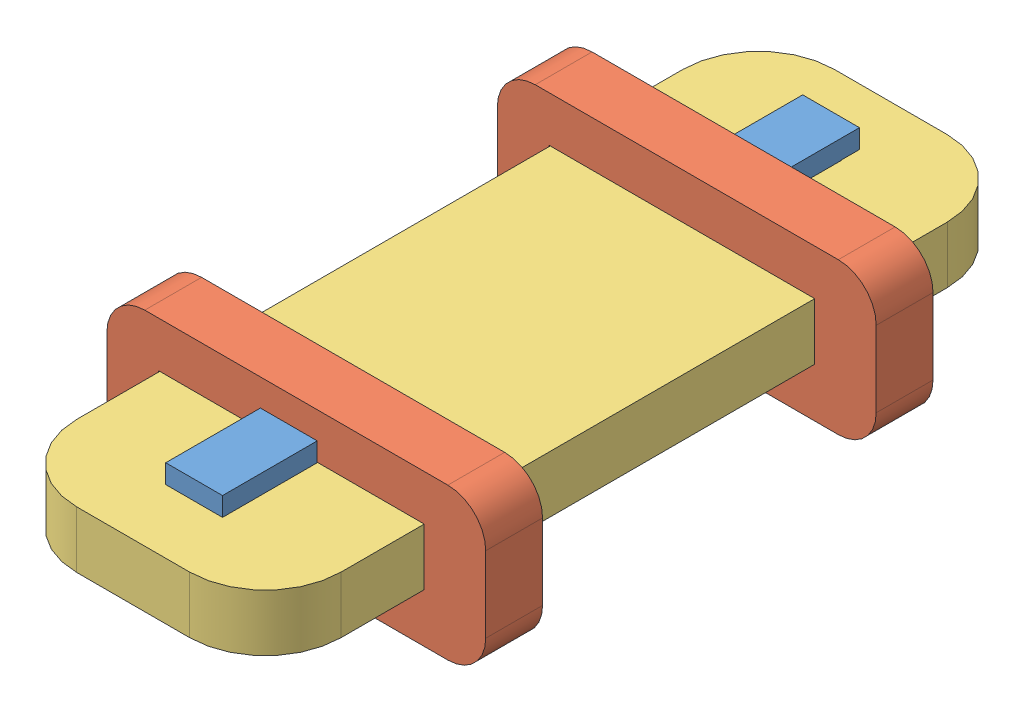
SolidWorks assembly assembly_test.SLDASM, configuration Default (file format 9000). Lengths in mm.
Overall size (100 40 200).
5 component instances, 3 part files, 12 mates.
Components (placement in the parent):
- cerrojo_part-1: cerrojo_part.SLDPRT [Default] at (9.1261 17.0755 16.5608) size (15 21 25)
- test_bar-1: test_bar.SLDPRT [Default] at (56.5099 10.8397 41.3426) x (1 0 0) z (0 -1 0) size (100 15 40)
- test_respaldo-1: test_respaldo.SLDPRT [Default] at (-7.9381 12.4846 -59.0885) x (0 0 1) z (-1 0 0) size (200 15 69.8)
- test_bar-2: test_bar.SLDPRT [Default] at (56.5099 10.8397 144.4084) x (1 0 0) z (0 -1 0) size (100 15 40)
- cerrojo_part-4: cerrojo_part.SLDPRT [Default] at (9.1579 17.0755 169.0902) x (-1 0 0) z (0 0 -1) size (15 21 25)
Mates (geometry in assembly coordinates):
- Coincident1: coincident anti-aligned: plane of test_respaldo-1 through (24.7997 4.9846 173.7426) normal (0 -1 0); plane of test_bar-2 through (-25.2003 4.9846 151.9084) normal (0 1 0)
- Coincident2: coincident anti-aligned: plane of test_bar-1 through (-25.2003 4.9846 48.8426) normal (0 1 0); plane of test_respaldo-1 through (24.7997 4.9846 173.7426) normal (0 -1 0)
- Coincident3: coincident anti-aligned: plane of test_respaldo-1 through (44.7997 19.9846 13.7426) normal (1 0 0); plane of test_bar-2 through (44.7997 20.0846 151.9084) normal (-1 0 0)
- Coincident4: coincident aligned: plane of test_respaldo-1 through (16.6579 19.9846 151.9084) normal (0 0 1); plane of test_bar-2 through (-28.8676 22.103 151.9084) normal (0 0 1)
- Coincident5: coincident aligned: plane of test_bar-1 through (-28.8676 22.103 33.8426) normal (0 0 -1); plane of test_respaldo-1 through (16.7261 19.9846 33.8426) normal (0 0 -1)
- Coincident6: coincident anti-aligned: plane of test_bar-1 through (44.7997 20.0846 48.8426) normal (-1 0 0); plane of test_respaldo-1 through (44.7997 19.9846 13.7426) normal (1 0 0)
- Coincident10: coincident anti-aligned: plane of cerrojo_part-1 through (16.6261 3.9846 13.7426) normal (0 0 -1); plane of test_respaldo-1 through (16.7261 19.9846 13.7426) normal (0 0 1)
- Coincident11: coincident anti-aligned: plane of cerrojo_part-1 through (16.6261 19.9846 13.7426) normal (0 -1 0); plane of test_respaldo-1 through (24.7997 19.9846 173.7426) normal (0 1 0)
- Coincident12: coincident anti-aligned: plane of cerrojo_part-1 through (1.6261 17.0755 16.5608) normal (-1 0 0); plane of test_respaldo-1 through (1.6261 19.9846 13.7426) normal (1 0 0)
- Coincident17: coincident anti-aligned: plane of test_bar-2 through (-28.8676 22.103 151.9084) normal (0 0 1); plane of cerrojo_part-4 through (-16.6376 24.9846 151.9084) normal (0 0 -1)
- Coincident18: coincident anti-aligned: plane of test_respaldo-1 through (24.7997 19.9846 173.7426) normal (0 1 0); plane of cerrojo_part-4 through (-16.6376 19.9846 171.9084) normal (0 -1 0)
- Coincident19: coincident anti-aligned: plane of test_respaldo-1 through (16.6579 19.9846 151.9084) normal (-1 0 0); plane of cerrojo_part-4 through (16.6579 17.0755 169.0902) normal (1 0 0)
